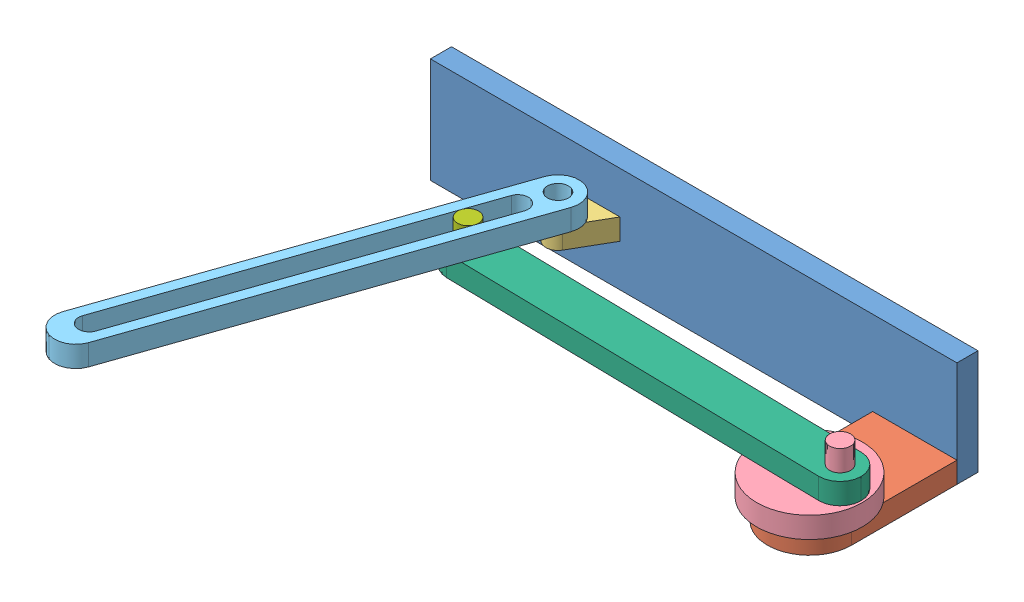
SolidWorks assembly linkage2-4bar.SLDASM, configuration Default (file format 6000). Lengths in mm.
Overall size (255.94 50 207.25).
7 component instances, 7 part files, 15 mates.
Components (placement in the parent):
- BASE-1: BASE.SLDPRT [Default] at (-20.7654 104.7281 181.6357) size (250 50 10)
- base1-1: base1.SLDPRT [Default] at (189.2346 114.7281 191.6357) x (1 0 0) z (0 -1 0) size (40 70 10)
- base2-1: base2.SLDPRT [Default] at (39.2346 134.7281 191.6357) x (1 0 0) z (0 -1 0) size (30 20.21 10)
- drive-1: drive.SLDPRT [Default] at (209.2346 114.7281 241.6357) x (0.038291 0 0.999267) z (0 1 0) size (50 50 30)
- slot-1: slot.SLDPRT [Default] at (66.9564 144.7281 199.8923) x (-0.327229 0 0.944945) z (0 -1 0) size (200 20 10)
- link-1: link.SLDPRT [Default] at (33.0721 124.7281 247.5891) x (0.999829 0 0.018468) z (0 1 0) size (200 20 10)
- pin-1: pin.SLDPRT [Default] at (43.255 124.7281 237.7754) x (-0.600342 0 0.799743) z (-0.799743 0 -0.600342) size (10 20 10)
Mates (geometry in assembly coordinates):
- Coincident1: coincident anti-aligned: plane of BASE-1 through (-20.7654 104.7281 191.6357) normal (0 0 1); plane of base1-1 through (229.2346 104.7281 191.6357) normal (0 0 -1)
- Coincident2: coincident aligned: line of BASE-1 through (-20.7654 104.7281 191.6357) axis (1 0 0); line of base1-1 through (189.2346 104.7281 191.6357) axis (1 0 0)
- Coincident3: coincident aligned: line of BASE-1 through (229.2346 104.7281 191.6357) axis (0 1 0); line of base1-1 through (229.2346 104.7281 191.6357) axis (0 1 0)
- Coincident4: coincident anti-aligned: plane of BASE-1 through (-20.7654 104.7281 191.6357) normal (0 0 1); plane of base2-1 through (69.2346 124.7281 191.6357) normal (0 0 -1)
- Coincident5: coincident anti-aligned: plane of base1-1 through (209.2346 114.7281 241.6357) normal (0 1 0); plane of drive-1 through (209.2346 114.7281 241.6357) normal (0 -1 0)
- Concentric1: concentric anti-aligned: cylinder of base1-1 through (209.2346 114.7281 241.6357) axis (0 -1 0) radius 5; cylinder of drive-1 through (209.2346 114.7281 241.6357) axis (0 1 0) radius 5
- Coincident7: coincident anti-aligned: plane of base2-1 through (54.2346 134.7281 206.0695) normal (0 1 0); plane of slot-1 through (66.9564 134.7281 199.8923) normal (0 -1 0)
- Concentric2: concentric aligned: cylinder of base2-1 through (54.2346 134.7281 206.0695) axis (0 -1 0) radius 5; cylinder of slot-1 through (54.2346 144.7281 206.0695) axis (0 -1 0) radius 5
- Distance2: distance = 60 mm: line of base2-1 through (39.2346 124.7281 191.6357) axis (0 1 0); line of BASE-1 through (-20.7654 154.7281 191.6357) axis (0 -1 0)
- Coincident8: coincident anti-aligned: plane of drive-1 through (209.2346 124.7281 241.6357) normal (0 1 0); plane of link-1 through (33.0721 124.7281 247.5891) normal (0 -1 0)
- Concentric3: concentric anti-aligned: cylinder of drive-1 through (223.2243 144.7281 241.0997) axis (0 -1 0) radius 5; cylinder of link-1 through (223.2243 124.7281 241.0997) axis (0 1 0) radius 5
- Concentric4: concentric anti-aligned: cylinder of link-1 through (43.255 124.7281 237.7754) axis (0 1 0) radius 5; cylinder of pin-1 through (43.255 144.7281 237.7754) axis (0 -1 0) radius 5
- Coincident9: coincident aligned: plane of link-1 through (33.0721 124.7281 247.5891) normal (0 -1 0); plane of pin-1 through (43.255 124.7281 237.7754) normal (0 -1 0)
- Coincident11: coincident anti-aligned: plane of slot-1 through (66.9564 134.7281 199.8923) normal (0 -1 0); plane of link-1 through (33.0721 134.7281 247.5891) normal (0 1 0)
- Tangent1: tangent anti-aligned: plane of slot-1 through (55.6871 144.7281 217.1551) normal (-0.944945 0 -0.327229); cylinder of pin-1 through (43.255 144.7281 237.7754) axis (0 -1 0) radius 5
